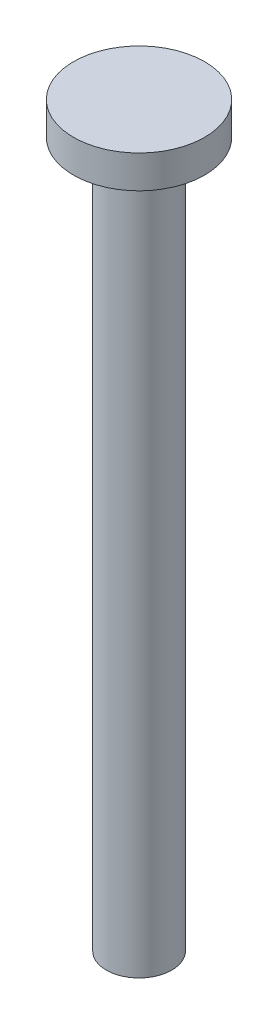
from build123d import *


with BuildPart() as part:
    # Szkic2 → Obr_t1 (revolve)
    with BuildSketch(Plane.XY, mode=Mode.PRIVATE) as obr_t1_sk:
        Polygon((-9.336055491, 39.400126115), (-17.336055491, 39.400126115), (-17.336055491, 35.400126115), (-13.336055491, 35.400126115), (-13.336055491, -50.599873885), (-9.336055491, -50.599873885), align=None)
    revolve(obr_t1_sk.sketch.rotate(Axis((-9.336055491, -50.599873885, 0), (0, 1, 0)), 270), axis=Axis((-9.336055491, -50.599873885, 0), (0, 1, 0)))


solid = part.part
